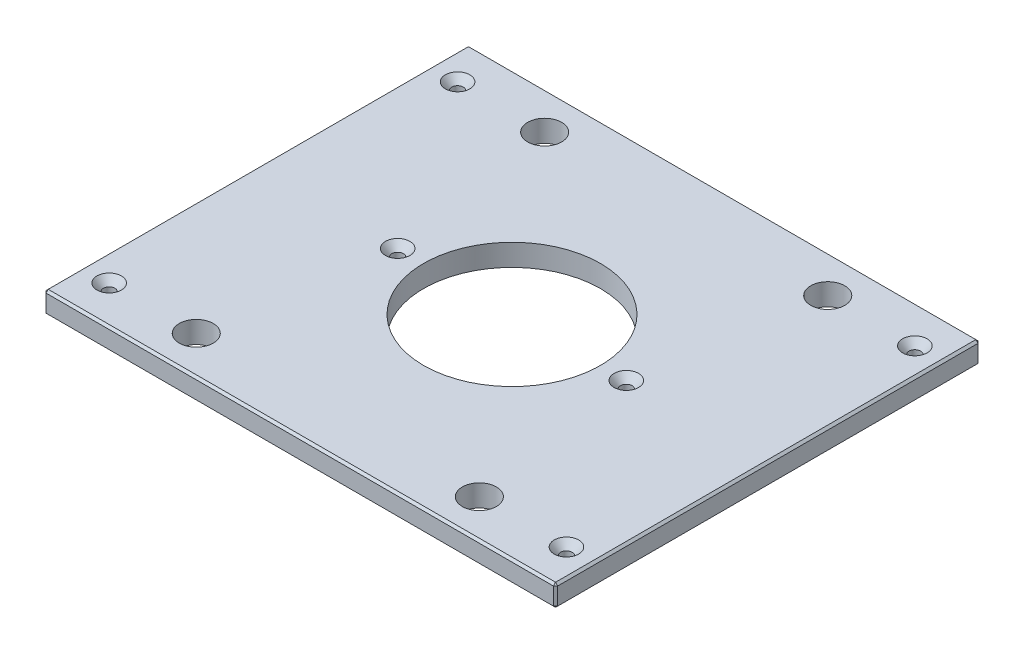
from build123d import *

# Parameters (mm, degrees)
SKETCH1_W                                        = 298.45
SKETCH1_H                                        = 247.65
BOSS_EXTRUDE1_DEPTH                              = 12.7
SKETCH13_R                                       = 51.562
CUT_EXTRUDE6_DEPTH                               = 195.324525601
F_25_32_0_78125_DIAMETER_HOLE1_D                 = 19.84375
CHAMFER2_SIZE                                    = 1.27
CSK_FOR_1_4_FLAT_HEAD_MACHINE_SCREW1_D           = 6.7564
CSK_FOR_1_4_FLAT_HEAD_MACHINE_SCREW1_CSINK_D     = 14.2748
CSK_FOR_1_4_FLAT_HEAD_MACHINE_SCREW1_CSINK_ANGLE = 82


with BuildPart() as part:
    # Sketch1 → Boss-Extrude1 (new body)
    with BuildSketch(Plane(origin=(0, 0, 0), x_dir=(1, 0, 0), z_dir=(0, 1, 0))):
        Rectangle(SKETCH1_W, SKETCH1_H)
    extrude(amount=BOSS_EXTRUDE1_DEPTH)

    # Sketch13 → Cut-Extrude6 (cut, through all)
    with BuildSketch(Plane(origin=(0, 12.7, 0), x_dir=(1, 0, 0), z_dir=(0, 1, 0))):
        with Locations(Location((0, 0, 0), (0, 0, 270))):
            Circle(SKETCH13_R)
    extrude(amount=-CUT_EXTRUDE6_DEPTH, mode=Mode.SUBTRACT)

    # 25_32 _0.78125_ Diameter Hole1 (through all)
    with Locations(Plane(origin=(0, 12.7, 0), x_dir=(1, 0, 0), z_dir=(0, 1, 0))):
        with Locations((82.55, 101.6), (-82.55, 101.6), (82.55, -101.6), (-82.55, -101.6)):
            Hole(F_25_32_0_78125_DIAMETER_HOLE1_D / 2)

    # Chamfer2
    chamfer2_edges = [part.edges().sort_by_distance(p)[0] for p in [
        (149.225, 12.7, 0),
        (0, 12.7, -123.825),
        (-149.225, 12.7, 0),
        (0, 0, -123.825),
        (149.225, 0, 0),
        (0, 0, 123.825),
        (-149.225, 0, 0),
        (0, 12.7, 123.825),
        (-149.225, 6.35, -123.825),
        (149.225, 6.35, -123.825),
        (149.225, 6.35, 123.825),
        (-149.225, 6.35, 123.825),
    ]]
    chamfer(chamfer2_edges, length=CHAMFER2_SIZE)

    # CSK for 1_4 Flat Head Machine Screw1 (through all)
    with Locations(Plane(origin=(0, 12.7, 0), x_dir=(1, 0, 0), z_dir=(0, 1, 0))):
        with Locations((133.35, 101.6), (133.35, -101.6), (-133.35, -101.6), (-66.675, 0), (66.675, 0), (-133.35, 101.6), (-82.55, 101.6), (-82.55, -101.6)):
            CounterSinkHole(CSK_FOR_1_4_FLAT_HEAD_MACHINE_SCREW1_D / 2, CSK_FOR_1_4_FLAT_HEAD_MACHINE_SCREW1_CSINK_D / 2, counter_sink_angle=CSK_FOR_1_4_FLAT_HEAD_MACHINE_SCREW1_CSINK_ANGLE)


solid = part.part
